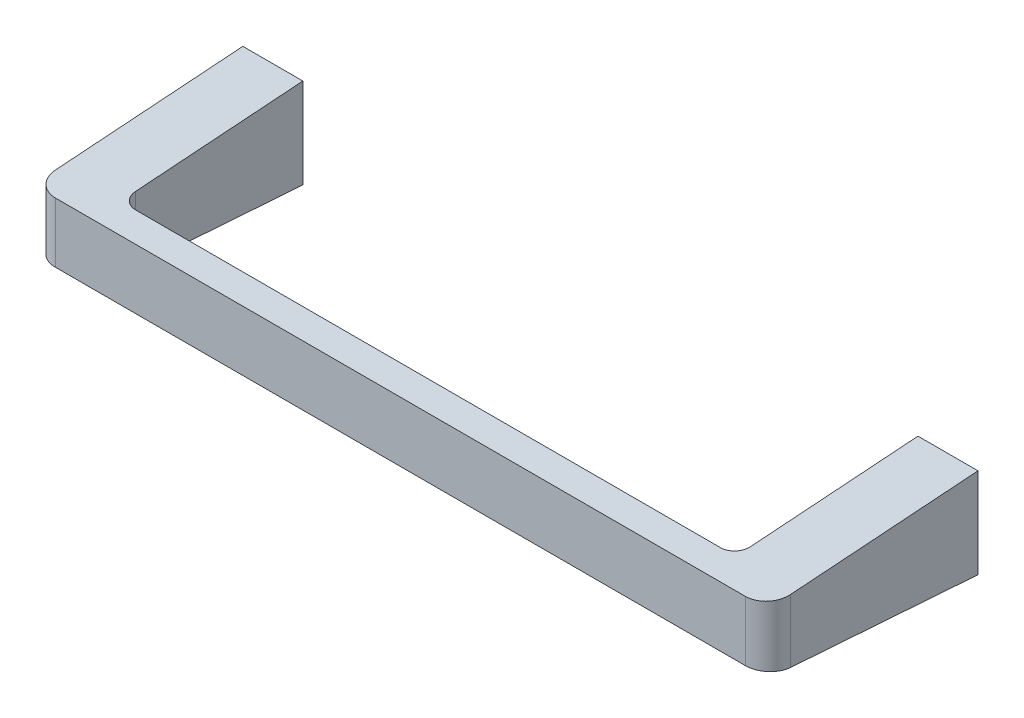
ISO-10303-21;
HEADER;
FILE_DESCRIPTION(('STEP AP214'),'2;1');
FILE_NAME('part.step','',(''),(''),'','','');
FILE_SCHEMA(('AUTOMOTIVE_DESIGN { 1 0 10303 214 1 1 1 1 }'));
ENDSEC;
DATA;
#1=APPLICATION_CONTEXT('core data for automotive mechanical design processes');
#2=APPLICATION_PROTOCOL_DEFINITION('international standard','automotive_design',2000,#1);
#3=PRODUCT_CONTEXT('',#1,'mechanical');
#4=PRODUCT('Part','Part','',(#3));
#5=PRODUCT_RELATED_PRODUCT_CATEGORY('part','',(#4));
#6=PRODUCT_DEFINITION_FORMATION('','',#4);
#7=PRODUCT_DEFINITION_CONTEXT('part definition',#1,'design');
#8=PRODUCT_DEFINITION('design','',#6,#7);
#9=PRODUCT_DEFINITION_SHAPE('','',#8);
#10=(LENGTH_UNIT() NAMED_UNIT(*) SI_UNIT(.MILLI.,.METRE.));
#11=(NAMED_UNIT(*) PLANE_ANGLE_UNIT() SI_UNIT($,.RADIAN.));
#12=(NAMED_UNIT(*) SI_UNIT($,.STERADIAN.) SOLID_ANGLE_UNIT());
#13=UNCERTAINTY_MEASURE_WITH_UNIT(LENGTH_MEASURE(1.E-05),#10,'distance_accuracy_value','');
#14=(GEOMETRIC_REPRESENTATION_CONTEXT(3) GLOBAL_UNCERTAINTY_ASSIGNED_CONTEXT((#13)) GLOBAL_UNIT_ASSIGNED_CONTEXT((#10,
#11,#12)) REPRESENTATION_CONTEXT('',''));
#15=CARTESIAN_POINT('',(0.,0.,0.));
#16=DIRECTION('',(0.,0.,1.));
#17=DIRECTION('',(1.,0.,0.));
#18=AXIS2_PLACEMENT_3D('',#15,#16,#17);
#19=CARTESIAN_POINT('',(-4.,-6.,0.));
#20=DIRECTION('',(0.,0.,1.));
#21=DIRECTION('',(0.,-1.,0.));
#22=AXIS2_PLACEMENT_3D('',#19,#20,#21);
#23=PLANE('',#22);
#24=DIRECTION('',(0.,1.,0.));
#25=VECTOR('',#24,1.);
#26=CARTESIAN_POINT('',(4.,-6.,0.));
#27=LINE('',#26,#25);
#28=CARTESIAN_POINT('',(4.,-6.,0.));
#29=VERTEX_POINT('',#28);
#30=CARTESIAN_POINT('',(4.,6.,0.));
#31=VERTEX_POINT('',#30);
#32=EDGE_CURVE('E152',#29,#31,#27,.T.);
#33=ORIENTED_EDGE('',*,*,#32,.F.);
#34=DIRECTION('',(1.,0.,0.));
#35=VECTOR('',#34,1.);
#36=CARTESIAN_POINT('',(-4.,-6.,0.));
#37=LINE('',#36,#35);
#38=CARTESIAN_POINT('',(-4.,-6.,0.));
#39=VERTEX_POINT('',#38);
#40=EDGE_CURVE('E127',#39,#29,#37,.T.);
#41=ORIENTED_EDGE('',*,*,#40,.F.);
#42=DIRECTION('',(0.,1.,0.));
#43=VECTOR('',#42,1.);
#44=CARTESIAN_POINT('',(-4.,-6.,0.));
#45=LINE('',#44,#43);
#46=CARTESIAN_POINT('',(-4.,6.,0.));
#47=VERTEX_POINT('',#46);
#48=EDGE_CURVE('E154',#39,#47,#45,.T.);
#49=ORIENTED_EDGE('',*,*,#48,.T.);
#50=DIRECTION('',(1.,0.,0.));
#51=VECTOR('',#50,1.);
#52=CARTESIAN_POINT('',(-4.,6.,0.));
#53=LINE('',#52,#51);
#54=EDGE_CURVE('E128',#47,#31,#53,.T.);
#55=ORIENTED_EDGE('',*,*,#54,.T.);
#56=EDGE_LOOP('',(#33,#41,#49,#55));
#57=FACE_BOUND('',#56,.T.);
#58=CARTESIAN_POINT('',(0.,0.,0.));
#59=DIRECTION('',(0.,0.,1.));
#60=DIRECTION('',(0.,-1.,0.));
#61=AXIS2_PLACEMENT_3D('',#58,#59,#60);
#62=CIRCLE('',#61,2.5);
#63=CARTESIAN_POINT('',(0.,-2.5,0.));
#64=VERTEX_POINT('',#63);
#65=EDGE_CURVE('E395',#64,#64,#62,.T.);
#66=ORIENTED_EDGE('',*,*,#65,.T.);
#67=EDGE_LOOP('',(#66));
#68=FACE_BOUND('',#67,.T.);
#69=ADVANCED_FACE('F14',(#57,#68),#23,.F.);
#70=CARTESIAN_POINT('',(91.,-6.,25.));
#71=DIRECTION('',(0.,1.,0.));
#72=DIRECTION('',(-1.,0.,0.));
#73=AXIS2_PLACEMENT_3D('',#70,#71,#72);
#74=CYLINDRICAL_SURFACE('',#73,3.);
#75=CARTESIAN_POINT('',(91.,4.21428571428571,25.));
#76=DIRECTION('',(0.,0.997458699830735,0.0712470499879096));
#77=DIRECTION('',(0.,0.0712470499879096,-0.997458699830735));
#78=AXIS2_PLACEMENT_3D('',#75,#76,#77);
#79=ELLIPSE('',#78,3.0076433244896,3.);
#80=CARTESIAN_POINT('',(91.,4.,28.));
#81=VERTEX_POINT('',#80);
#82=CARTESIAN_POINT('',(94.,4.21428571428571,25.));
#83=VERTEX_POINT('',#82);
#84=EDGE_CURVE('E108',#81,#83,#79,.T.);
#85=ORIENTED_EDGE('',*,*,#84,.F.);
#86=DIRECTION('',(0.,1.,0.));
#87=VECTOR('',#86,1.);
#88=CARTESIAN_POINT('',(91.,-6.,28.));
#89=LINE('',#88,#87);
#90=CARTESIAN_POINT('',(91.,-4.,28.));
#91=VERTEX_POINT('',#90);
#92=EDGE_CURVE('E9',#91,#81,#89,.T.);
#93=ORIENTED_EDGE('',*,*,#92,.F.);
#94=CARTESIAN_POINT('',(91.,-4.21428571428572,25.));
#95=DIRECTION('',(0.,0.997458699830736,-0.0712470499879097));
#96=DIRECTION('',(0.,0.0712470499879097,0.997458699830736));
#97=AXIS2_PLACEMENT_3D('',#94,#95,#96);
#98=ELLIPSE('',#97,3.0076433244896,3.);
#99=CARTESIAN_POINT('',(94.,-4.21428571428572,25.));
#100=VERTEX_POINT('',#99);
#101=EDGE_CURVE('E133',#91,#100,#98,.T.);
#102=ORIENTED_EDGE('',*,*,#101,.T.);
#103=DIRECTION('',(0.,1.,0.));
#104=VECTOR('',#103,1.);
#105=CARTESIAN_POINT('',(94.,-6.,25.));
#106=LINE('',#105,#104);
#107=EDGE_CURVE('E123',#100,#83,#106,.T.);
#108=ORIENTED_EDGE('',*,*,#107,.T.);
#109=EDGE_LOOP('',(#85,#93,#102,#108));
#110=FACE_BOUND('',#109,.T.);
#111=ADVANCED_FACE('F209',(#110),#74,.T.);
#112=CARTESIAN_POINT('',(91.,-6.,28.));
#113=DIRECTION('',(0.,0.,-1.));
#114=DIRECTION('',(0.,1.,0.));
#115=AXIS2_PLACEMENT_3D('',#112,#113,#114);
#116=PLANE('',#115);
#117=DIRECTION('',(-1.,0.,0.));
#118=VECTOR('',#117,1.);
#119=CARTESIAN_POINT('',(94.,4.,28.));
#120=LINE('',#119,#118);
#121=CARTESIAN_POINT('',(-1.,4.,28.));
#122=VERTEX_POINT('',#121);
#123=EDGE_CURVE('E112',#81,#122,#120,.T.);
#124=ORIENTED_EDGE('',*,*,#123,.T.);
#125=DIRECTION('',(0.,1.,0.));
#126=VECTOR('',#125,1.);
#127=CARTESIAN_POINT('',(-1.,-6.,28.));
#128=LINE('',#127,#126);
#129=CARTESIAN_POINT('',(-1.,-4.,28.));
#130=VERTEX_POINT('',#129);
#131=EDGE_CURVE('E22',#130,#122,#128,.T.);
#132=ORIENTED_EDGE('',*,*,#131,.F.);
#133=DIRECTION('',(-1.,0.,0.));
#134=VECTOR('',#133,1.);
#135=CARTESIAN_POINT('',(94.,-4.,28.));
#136=LINE('',#135,#134);
#137=EDGE_CURVE('E171',#91,#130,#136,.T.);
#138=ORIENTED_EDGE('',*,*,#137,.F.);
#139=ORIENTED_EDGE('',*,*,#92,.T.);
#140=EDGE_LOOP('',(#124,#132,#138,#139));
#141=FACE_BOUND('',#140,.T.);
#142=ADVANCED_FACE('F16',(#141),#116,.F.);
#143=CARTESIAN_POINT('',(-1.,-6.,25.));
#144=DIRECTION('',(0.,1.,0.));
#145=DIRECTION('',(-1.,0.,0.));
#146=AXIS2_PLACEMENT_3D('',#143,#144,#145);
#147=CYLINDRICAL_SURFACE('',#146,3.);
#148=CARTESIAN_POINT('',(-1.,4.21428571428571,25.));
#149=DIRECTION('',(0.,0.997458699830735,0.0712470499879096));
#150=DIRECTION('',(0.,0.0712470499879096,-0.997458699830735));
#151=AXIS2_PLACEMENT_3D('',#148,#149,#150);
#152=ELLIPSE('',#151,3.00764332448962,3.);
#153=CARTESIAN_POINT('',(-4.,4.21428571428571,25.));
#154=VERTEX_POINT('',#153);
#155=EDGE_CURVE('E166',#154,#122,#152,.T.);
#156=ORIENTED_EDGE('',*,*,#155,.F.);
#157=DIRECTION('',(0.,1.,0.));
#158=VECTOR('',#157,1.);
#159=CARTESIAN_POINT('',(-4.,-6.,25.));
#160=LINE('',#159,#158);
#161=CARTESIAN_POINT('',(-4.,-4.21428571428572,25.));
#162=VERTEX_POINT('',#161);
#163=EDGE_CURVE('E157',#162,#154,#160,.T.);
#164=ORIENTED_EDGE('',*,*,#163,.F.);
#165=CARTESIAN_POINT('',(-1.,-4.21428571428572,25.));
#166=DIRECTION('',(0.,0.997458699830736,-0.0712470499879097));
#167=DIRECTION('',(0.,0.0712470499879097,0.997458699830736));
#168=AXIS2_PLACEMENT_3D('',#165,#166,#167);
#169=ELLIPSE('',#168,3.00764332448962,3.);
#170=EDGE_CURVE('E167',#162,#130,#169,.T.);
#171=ORIENTED_EDGE('',*,*,#170,.T.);
#172=ORIENTED_EDGE('',*,*,#131,.T.);
#173=EDGE_LOOP('',(#156,#164,#171,#172));
#174=FACE_BOUND('',#173,.T.);
#175=ADVANCED_FACE('F164',(#174),#147,.T.);
#176=CARTESIAN_POINT('',(-4.,-6.,25.));
#177=DIRECTION('',(1.,0.,0.));
#178=DIRECTION('',(0.,1.,0.));
#179=AXIS2_PLACEMENT_3D('',#176,#177,#178);
#180=PLANE('',#179);
#181=DIRECTION('',(0.,-0.0712470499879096,0.997458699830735));
#182=VECTOR('',#181,1.);
#183=CARTESIAN_POINT('',(-4.,4.16243654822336,25.725888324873));
#184=LINE('',#183,#182);
#185=EDGE_CURVE('E188',#47,#154,#184,.T.);
#186=ORIENTED_EDGE('',*,*,#185,.F.);
#187=ORIENTED_EDGE('',*,*,#48,.F.);
#188=DIRECTION('',(0.,0.0712470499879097,0.997458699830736));
#189=VECTOR('',#188,1.);
#190=CARTESIAN_POINT('',(-4.,-4.2233502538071,24.8730964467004));
#191=LINE('',#190,#189);
#192=EDGE_CURVE('E204',#39,#162,#191,.T.);
#193=ORIENTED_EDGE('',*,*,#192,.T.);
#194=ORIENTED_EDGE('',*,*,#163,.T.);
#195=EDGE_LOOP('',(#186,#187,#193,#194));
#196=FACE_BOUND('',#195,.T.);
#197=ADVANCED_FACE('F214',(#196),#180,.F.);
#198=CARTESIAN_POINT('',(4.,-6.,0.));
#199=DIRECTION('',(-1.,0.,0.));
#200=DIRECTION('',(0.,-1.,0.));
#201=AXIS2_PLACEMENT_3D('',#198,#199,#200);
#202=PLANE('',#201);
#203=DIRECTION('',(0.,0.0712470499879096,-0.997458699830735));
#204=VECTOR('',#203,1.);
#205=CARTESIAN_POINT('',(4.,5.93908629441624,0.852791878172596));
#206=LINE('',#205,#204);
#207=CARTESIAN_POINT('',(4.,4.40714285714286,22.3));
#208=VERTEX_POINT('',#207);
#209=EDGE_CURVE('E37',#208,#31,#206,.T.);
#210=ORIENTED_EDGE('',*,*,#209,.F.);
#211=DIRECTION('',(0.,1.,0.));
#212=VECTOR('',#211,1.);
#213=CARTESIAN_POINT('',(4.,-6.,22.3));
#214=LINE('',#213,#212);
#215=CARTESIAN_POINT('',(4.,-4.40714285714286,22.3));
#216=VERTEX_POINT('',#215);
#217=EDGE_CURVE('E149',#216,#208,#214,.T.);
#218=ORIENTED_EDGE('',*,*,#217,.F.);
#219=DIRECTION('',(0.,-0.0712470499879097,-0.997458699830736));
#220=VECTOR('',#219,1.);
#221=CARTESIAN_POINT('',(4.,-6.,0.));
#222=LINE('',#221,#220);
#223=EDGE_CURVE('E201',#216,#29,#222,.T.);
#224=ORIENTED_EDGE('',*,*,#223,.T.);
#225=ORIENTED_EDGE('',*,*,#32,.T.);
#226=EDGE_LOOP('',(#210,#218,#224,#225));
#227=FACE_BOUND('',#226,.T.);
#228=ADVANCED_FACE('F222',(#227),#202,.F.);
#229=CARTESIAN_POINT('',(6.,-6.,22.3));
#230=DIRECTION('',(0.,1.,0.));
#231=DIRECTION('',(-1.,0.,0.));
#232=AXIS2_PLACEMENT_3D('',#229,#230,#231);
#233=CYLINDRICAL_SURFACE('',#232,2.);
#234=ORIENTED_EDGE('',*,*,#217,.T.);
#235=CARTESIAN_POINT('',(6.,4.40714285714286,22.3));
#236=DIRECTION('',(0.,0.997458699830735,0.0712470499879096));
#237=DIRECTION('',(0.,0.0712470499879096,-0.997458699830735));
#238=AXIS2_PLACEMENT_3D('',#235,#236,#237);
#239=ELLIPSE('',#238,2.00509554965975,2.);
#240=CARTESIAN_POINT('',(6.,4.26428571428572,24.3));
#241=VERTEX_POINT('',#240);
#242=EDGE_CURVE('E184',#208,#241,#239,.T.);
#243=ORIENTED_EDGE('',*,*,#242,.T.);
#244=DIRECTION('',(0.,1.,0.));
#245=VECTOR('',#244,1.);
#246=CARTESIAN_POINT('',(6.,-6.,24.3));
#247=LINE('',#246,#245);
#248=CARTESIAN_POINT('',(6.,-4.26428571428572,24.3));
#249=VERTEX_POINT('',#248);
#250=EDGE_CURVE('E146',#249,#241,#247,.T.);
#251=ORIENTED_EDGE('',*,*,#250,.F.);
#252=CARTESIAN_POINT('',(6.,-4.40714285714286,22.3));
#253=DIRECTION('',(0.,0.997458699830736,-0.0712470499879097));
#254=DIRECTION('',(0.,0.0712470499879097,0.997458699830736));
#255=AXIS2_PLACEMENT_3D('',#252,#253,#254);
#256=ELLIPSE('',#255,2.00509554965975,2.);
#257=EDGE_CURVE('E199',#216,#249,#256,.T.);
#258=ORIENTED_EDGE('',*,*,#257,.F.);
#259=EDGE_LOOP('',(#234,#243,#251,#258));
#260=FACE_BOUND('',#259,.T.);
#261=ADVANCED_FACE('F224',(#260),#233,.F.);
#262=CARTESIAN_POINT('',(84.,-6.,24.3));
#263=DIRECTION('',(0.,0.,-1.));
#264=DIRECTION('',(0.,1.,0.));
#265=AXIS2_PLACEMENT_3D('',#262,#263,#264);
#266=PLANE('',#265);
#267=ORIENTED_EDGE('',*,*,#250,.T.);
#268=DIRECTION('',(1.,0.,0.));
#269=VECTOR('',#268,1.);
#270=CARTESIAN_POINT('',(84.,4.26428571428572,24.3));
#271=LINE('',#270,#269);
#272=CARTESIAN_POINT('',(84.,4.26428571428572,24.3));
#273=VERTEX_POINT('',#272);
#274=EDGE_CURVE('E181',#241,#273,#271,.T.);
#275=ORIENTED_EDGE('',*,*,#274,.T.);
#276=DIRECTION('',(0.,1.,0.));
#277=VECTOR('',#276,1.);
#278=CARTESIAN_POINT('',(84.,-6.,24.3));
#279=LINE('',#278,#277);
#280=CARTESIAN_POINT('',(84.,-4.26428571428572,24.3));
#281=VERTEX_POINT('',#280);
#282=EDGE_CURVE('E143',#281,#273,#279,.T.);
#283=ORIENTED_EDGE('',*,*,#282,.F.);
#284=DIRECTION('',(1.,0.,0.));
#285=VECTOR('',#284,1.);
#286=CARTESIAN_POINT('',(84.,-4.26428571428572,24.3));
#287=LINE('',#286,#285);
#288=EDGE_CURVE('E197',#249,#281,#287,.T.);
#289=ORIENTED_EDGE('',*,*,#288,.F.);
#290=EDGE_LOOP('',(#267,#275,#283,#289));
#291=FACE_BOUND('',#290,.T.);
#292=ADVANCED_FACE('F230',(#291),#266,.T.);
#293=CARTESIAN_POINT('',(84.,-6.,22.3));
#294=DIRECTION('',(0.,1.,0.));
#295=DIRECTION('',(-1.,0.,0.));
#296=AXIS2_PLACEMENT_3D('',#293,#294,#295);
#297=CYLINDRICAL_SURFACE('',#296,2.);
#298=ORIENTED_EDGE('',*,*,#282,.T.);
#299=CARTESIAN_POINT('',(84.,4.40714285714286,22.3));
#300=DIRECTION('',(0.,0.997458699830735,0.0712470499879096));
#301=DIRECTION('',(0.,0.0712470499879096,-0.997458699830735));
#302=AXIS2_PLACEMENT_3D('',#299,#300,#301);
#303=ELLIPSE('',#302,2.00509554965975,2.);
#304=CARTESIAN_POINT('',(86.,4.40714285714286,22.3));
#305=VERTEX_POINT('',#304);
#306=EDGE_CURVE('E175',#273,#305,#303,.T.);
#307=ORIENTED_EDGE('',*,*,#306,.T.);
#308=DIRECTION('',(0.,1.,0.));
#309=VECTOR('',#308,1.);
#310=CARTESIAN_POINT('',(86.,-6.,22.3));
#311=LINE('',#310,#309);
#312=CARTESIAN_POINT('',(86.,-4.40714285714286,22.3));
#313=VERTEX_POINT('',#312);
#314=EDGE_CURVE('E140',#313,#305,#311,.T.);
#315=ORIENTED_EDGE('',*,*,#314,.F.);
#316=CARTESIAN_POINT('',(84.,-4.40714285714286,22.3));
#317=DIRECTION('',(0.,0.997458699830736,-0.0712470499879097));
#318=DIRECTION('',(0.,0.0712470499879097,0.997458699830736));
#319=AXIS2_PLACEMENT_3D('',#316,#317,#318);
#320=ELLIPSE('',#319,2.00509554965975,2.);
#321=EDGE_CURVE('E195',#281,#313,#320,.T.);
#322=ORIENTED_EDGE('',*,*,#321,.F.);
#323=EDGE_LOOP('',(#298,#307,#315,#322));
#324=FACE_BOUND('',#323,.T.);
#325=ADVANCED_FACE('F232',(#324),#297,.F.);
#326=CARTESIAN_POINT('',(86.,-6.,0.));
#327=DIRECTION('',(-1.,0.,0.));
#328=DIRECTION('',(0.,0.,-1.));
#329=AXIS2_PLACEMENT_3D('',#326,#327,#328);
#330=PLANE('',#329);
#331=ORIENTED_EDGE('',*,*,#314,.T.);
#332=DIRECTION('',(0.,0.0712470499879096,-0.997458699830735));
#333=VECTOR('',#332,1.);
#334=CARTESIAN_POINT('',(86.,5.93908629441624,0.852791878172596));
#335=LINE('',#334,#333);
#336=CARTESIAN_POINT('',(86.,6.,0.));
#337=VERTEX_POINT('',#336);
#338=EDGE_CURVE('E173',#305,#337,#335,.T.);
#339=ORIENTED_EDGE('',*,*,#338,.T.);
#340=DIRECTION('',(0.,1.,0.));
#341=VECTOR('',#340,1.);
#342=CARTESIAN_POINT('',(86.,-6.,0.));
#343=LINE('',#342,#341);
#344=CARTESIAN_POINT('',(86.,-6.,0.));
#345=VERTEX_POINT('',#344);
#346=EDGE_CURVE('E122',#345,#337,#343,.T.);
#347=ORIENTED_EDGE('',*,*,#346,.F.);
#348=DIRECTION('',(0.,-0.0712470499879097,-0.997458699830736));
#349=VECTOR('',#348,1.);
#350=CARTESIAN_POINT('',(86.,-6.,0.));
#351=LINE('',#350,#349);
#352=EDGE_CURVE('E29',#313,#345,#351,.T.);
#353=ORIENTED_EDGE('',*,*,#352,.F.);
#354=EDGE_LOOP('',(#331,#339,#347,#353));
#355=FACE_BOUND('',#354,.T.);
#356=ADVANCED_FACE('F235',(#355),#330,.T.);
#357=CARTESIAN_POINT('',(94.,-6.,25.));
#358=DIRECTION('',(1.,0.,0.));
#359=DIRECTION('',(0.,1.,0.));
#360=AXIS2_PLACEMENT_3D('',#357,#358,#359);
#361=PLANE('',#360);
#362=DIRECTION('',(0.,1.,0.));
#363=VECTOR('',#362,1.);
#364=CARTESIAN_POINT('',(94.,-6.,0.));
#365=LINE('',#364,#363);
#366=CARTESIAN_POINT('',(94.,-6.,0.));
#367=VERTEX_POINT('',#366);
#368=CARTESIAN_POINT('',(94.,6.,0.));
#369=VERTEX_POINT('',#368);
#370=EDGE_CURVE('E117',#367,#369,#365,.T.);
#371=ORIENTED_EDGE('',*,*,#370,.T.);
#372=DIRECTION('',(0.,0.0712470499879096,-0.997458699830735));
#373=VECTOR('',#372,1.);
#374=CARTESIAN_POINT('',(94.,4.,28.));
#375=LINE('',#374,#373);
#376=EDGE_CURVE('E101',#83,#369,#375,.T.);
#377=ORIENTED_EDGE('',*,*,#376,.F.);
#378=ORIENTED_EDGE('',*,*,#107,.F.);
#379=DIRECTION('',(0.,-0.0712470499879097,-0.997458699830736));
#380=VECTOR('',#379,1.);
#381=CARTESIAN_POINT('',(94.,-4.,28.));
#382=LINE('',#381,#380);
#383=EDGE_CURVE('E119',#100,#367,#382,.T.);
#384=ORIENTED_EDGE('',*,*,#383,.T.);
#385=EDGE_LOOP('',(#371,#377,#378,#384));
#386=FACE_BOUND('',#385,.T.);
#387=ADVANCED_FACE('F118',(#386),#361,.T.);
#388=CARTESIAN_POINT('',(94.,-6.,0.));
#389=DIRECTION('',(0.,0.,-1.));
#390=DIRECTION('',(0.,1.,0.));
#391=AXIS2_PLACEMENT_3D('',#388,#389,#390);
#392=PLANE('',#391);
#393=CARTESIAN_POINT('',(90.,0.,0.));
#394=DIRECTION('',(0.,0.,-1.));
#395=DIRECTION('',(0.,1.,0.));
#396=AXIS2_PLACEMENT_3D('',#393,#394,#395);
#397=CIRCLE('',#396,2.5);
#398=CARTESIAN_POINT('',(90.,2.5,0.));
#399=VERTEX_POINT('',#398);
#400=EDGE_CURVE('E394',#399,#399,#397,.T.);
#401=ORIENTED_EDGE('',*,*,#400,.F.);
#402=EDGE_LOOP('',(#401));
#403=FACE_BOUND('',#402,.T.);
#404=ORIENTED_EDGE('',*,*,#370,.F.);
#405=DIRECTION('',(-1.,0.,0.));
#406=VECTOR('',#405,1.);
#407=CARTESIAN_POINT('',(94.,-6.,0.));
#408=LINE('',#407,#406);
#409=EDGE_CURVE('E130',#367,#345,#408,.T.);
#410=ORIENTED_EDGE('',*,*,#409,.T.);
#411=ORIENTED_EDGE('',*,*,#346,.T.);
#412=DIRECTION('',(-1.,0.,0.));
#413=VECTOR('',#412,1.);
#414=CARTESIAN_POINT('',(94.,6.,0.));
#415=LINE('',#414,#413);
#416=EDGE_CURVE('E105',#369,#337,#415,.T.);
#417=ORIENTED_EDGE('',*,*,#416,.F.);
#418=EDGE_LOOP('',(#404,#410,#411,#417));
#419=FACE_BOUND('',#418,.T.);
#420=ADVANCED_FACE('F126',(#403,#419),#392,.T.);
#421=CARTESIAN_POINT('',(94.,-4.,28.));
#422=DIRECTION('',(0.,0.997458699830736,-0.0712470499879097));
#423=DIRECTION('',(0.,0.0712470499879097,0.997458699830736));
#424=AXIS2_PLACEMENT_3D('',#421,#422,#423);
#425=PLANE('',#424);
#426=ORIENTED_EDGE('',*,*,#137,.T.);
#427=ORIENTED_EDGE('',*,*,#170,.F.);
#428=ORIENTED_EDGE('',*,*,#192,.F.);
#429=ORIENTED_EDGE('',*,*,#40,.T.);
#430=ORIENTED_EDGE('',*,*,#223,.F.);
#431=ORIENTED_EDGE('',*,*,#257,.T.);
#432=ORIENTED_EDGE('',*,*,#288,.T.);
#433=ORIENTED_EDGE('',*,*,#321,.T.);
#434=ORIENTED_EDGE('',*,*,#352,.T.);
#435=ORIENTED_EDGE('',*,*,#409,.F.);
#436=ORIENTED_EDGE('',*,*,#383,.F.);
#437=ORIENTED_EDGE('',*,*,#101,.F.);
#438=EDGE_LOOP('',(#426,#427,#428,#429,#430,#431,#432,#433,#434,#435,#436,#437));
#439=FACE_BOUND('',#438,.T.);
#440=ADVANCED_FACE('F210',(#439),#425,.F.);
#441=CARTESIAN_POINT('',(94.,4.,28.));
#442=DIRECTION('',(0.,0.997458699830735,0.0712470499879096));
#443=DIRECTION('',(0.,-0.0712470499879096,0.997458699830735));
#444=AXIS2_PLACEMENT_3D('',#441,#442,#443);
#445=PLANE('',#444);
#446=ORIENTED_EDGE('',*,*,#84,.T.);
#447=ORIENTED_EDGE('',*,*,#376,.T.);
#448=ORIENTED_EDGE('',*,*,#416,.T.);
#449=ORIENTED_EDGE('',*,*,#338,.F.);
#450=ORIENTED_EDGE('',*,*,#306,.F.);
#451=ORIENTED_EDGE('',*,*,#274,.F.);
#452=ORIENTED_EDGE('',*,*,#242,.F.);
#453=ORIENTED_EDGE('',*,*,#209,.T.);
#454=ORIENTED_EDGE('',*,*,#54,.F.);
#455=ORIENTED_EDGE('',*,*,#185,.T.);
#456=ORIENTED_EDGE('',*,*,#155,.T.);
#457=ORIENTED_EDGE('',*,*,#123,.F.);
#458=EDGE_LOOP('',(#446,#447,#448,#449,#450,#451,#452,#453,#454,#455,#456,#457));
#459=FACE_BOUND('',#458,.T.);
#460=ADVANCED_FACE('F103',(#459),#445,.T.);
#461=CARTESIAN_POINT('',(90.,0.,10.));
#462=DIRECTION('',(0.,0.,-1.));
#463=DIRECTION('',(0.,1.,0.));
#464=AXIS2_PLACEMENT_3D('',#461,#462,#463);
#465=CYLINDRICAL_SURFACE('',#464,2.5);
#466=CARTESIAN_POINT('',(90.,0.,10.));
#467=DIRECTION('',(0.,0.,-1.));
#468=DIRECTION('',(0.,1.,0.));
#469=AXIS2_PLACEMENT_3D('',#466,#467,#468);
#470=CIRCLE('',#469,2.5);
#471=CARTESIAN_POINT('',(90.,2.5,10.));
#472=VERTEX_POINT('',#471);
#473=EDGE_CURVE('E113',#472,#472,#470,.T.);
#474=ORIENTED_EDGE('',*,*,#473,.F.);
#475=EDGE_LOOP('',(#474));
#476=FACE_BOUND('',#475,.T.);
#477=ORIENTED_EDGE('',*,*,#400,.T.);
#478=EDGE_LOOP('',(#477));
#479=FACE_BOUND('',#478,.T.);
#480=ADVANCED_FACE('F346',(#476,#479),#465,.F.);
#481=CARTESIAN_POINT('',(90.,0.,10.));
#482=DIRECTION('',(0.,0.,-1.));
#483=DIRECTION('',(0.,1.,0.));
#484=AXIS2_PLACEMENT_3D('',#481,#482,#483);
#485=PLANE('',#484);
#486=ORIENTED_EDGE('',*,*,#473,.T.);
#487=EDGE_LOOP('',(#486));
#488=FACE_BOUND('',#487,.T.);
#489=ADVANCED_FACE('F348',(#488),#485,.T.);
#490=CARTESIAN_POINT('',(0.,0.,10.));
#491=DIRECTION('',(0.,0.,-1.));
#492=DIRECTION('',(0.,1.,0.));
#493=AXIS2_PLACEMENT_3D('',#490,#491,#492);
#494=CYLINDRICAL_SURFACE('',#493,2.5);
#495=CARTESIAN_POINT('',(0.,0.,10.));
#496=DIRECTION('',(0.,0.,1.));
#497=DIRECTION('',(0.,-1.,0.));
#498=AXIS2_PLACEMENT_3D('',#495,#496,#497);
#499=CIRCLE('',#498,2.5);
#500=CARTESIAN_POINT('',(0.,-2.5,10.));
#501=VERTEX_POINT('',#500);
#502=EDGE_CURVE('E393',#501,#501,#499,.T.);
#503=ORIENTED_EDGE('',*,*,#502,.T.);
#504=EDGE_LOOP('',(#503));
#505=FACE_BOUND('',#504,.T.);
#506=ORIENTED_EDGE('',*,*,#65,.F.);
#507=EDGE_LOOP('',(#506));
#508=FACE_BOUND('',#507,.T.);
#509=ADVANCED_FACE('F364',(#505,#508),#494,.F.);
#510=CARTESIAN_POINT('',(0.,0.,10.));
#511=DIRECTION('',(0.,0.,1.));
#512=DIRECTION('',(0.,-1.,0.));
#513=AXIS2_PLACEMENT_3D('',#510,#511,#512);
#514=PLANE('',#513);
#515=ORIENTED_EDGE('',*,*,#502,.F.);
#516=EDGE_LOOP('',(#515));
#517=FACE_BOUND('',#516,.T.);
#518=ADVANCED_FACE('F357',(#517),#514,.F.);
#519=CLOSED_SHELL('',(#69,#111,#142,#175,#197,#228,#261,#292,#325,#356,#387,#420,#440,#460,#480,
#489,#509,#518));
#520=MANIFOLD_SOLID_BREP('B1',#519);
#521=ADVANCED_BREP_SHAPE_REPRESENTATION('',(#18,#520),#14);
#522=SHAPE_DEFINITION_REPRESENTATION(#9,#521);
ENDSEC;
END-ISO-10303-21;
